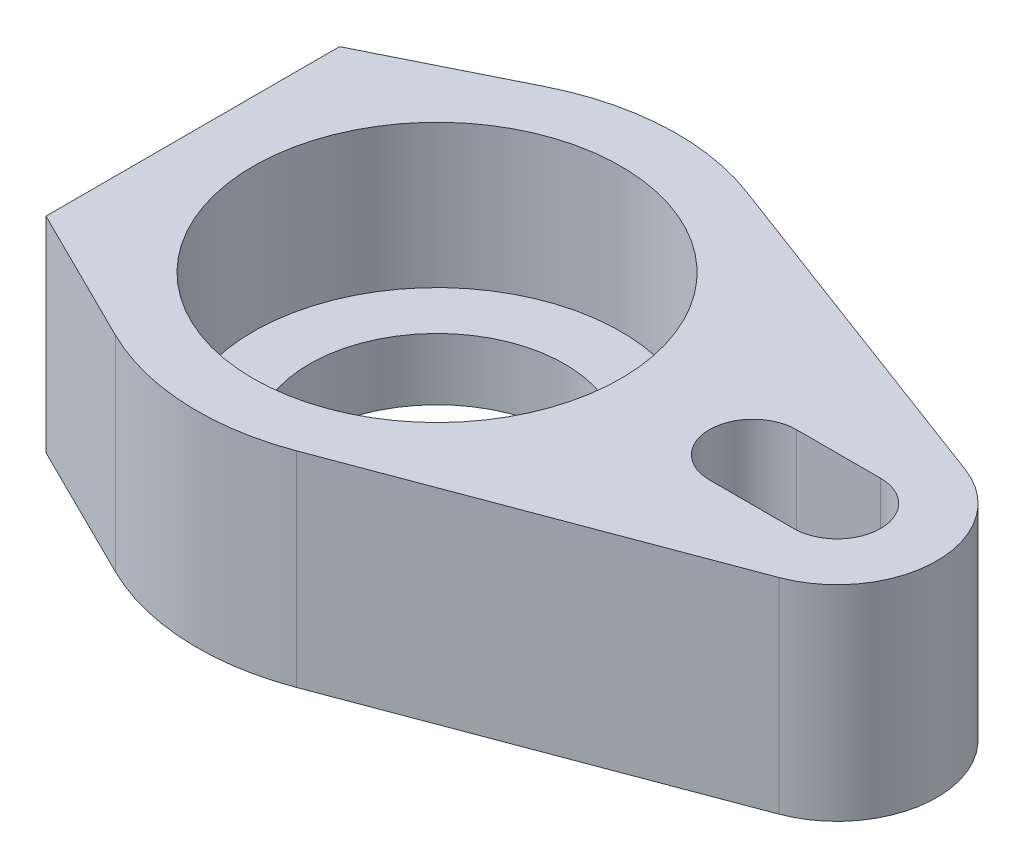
from build123d import *

# Parameters (mm, degrees)
SKETCH1_R     = 6.55
BODY_DEPTH    = 7.3
FLOOR_2_DEPTH = 2.2


with BuildPart() as part:
    # Sketch1 → Body (new body)
    with BuildSketch(Plane(origin=(0, 0, 0), x_dir=(1, 0, 0), z_dir=(0, 1, 0))):
        with BuildLine():
            Line((3, -8.006403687), (15.495614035, -3.324296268))
            ThreePointArc((15.495614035, -3.324296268), (17.8, 0), (15.495614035, 3.324296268))
            Line((15.495614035, 3.324296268), (3, 8.006403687))
            ThreePointArc((3, 8.006403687), (-0.436058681, 8.538873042), (-3.8, 7.659144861))
            Line((-3.8, 7.659144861), (-8.7, 5.228064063))
            Line((-8.7, 5.228064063), (-8.7, -5.228064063))
            Line((-8.7, -5.228064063), (-3.8, -7.659144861))
            ThreePointArc((-3.8, -7.659144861), (-0.436058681, -8.538873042), (3, -8.006403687))
        make_face()
        with Locations(Location((0, 0, 0), (0, 0, 270))):
            Circle(SKETCH1_R, mode=Mode.SUBTRACT)
        with BuildLine():
            Line((11.25, 1.55), (14.25, 1.55))
            ThreePointArc((14.25, 1.55), (15.8, 0), (14.25, -1.55))
            Line((14.25, -1.55), (11.25, -1.55))
            ThreePointArc((11.25, -1.55), (9.7, 0), (11.25, 1.55))
        make_face(mode=Mode.SUBTRACT)
    extrude(amount=BODY_DEPTH)

    # Sketch1_4 → Floor 2 (add)
    with BuildSketch(Plane(origin=(0, 0, 0), x_dir=(1, 0, 0), z_dir=(0, 1, 0))):
        with BuildLine():
            ThreePointArc((6.55, 0), (6.413226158, 1.33155182), (6.008616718, 2.607494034))
            Line((6.008616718, 2.607494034), (1.596491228, 4.260717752))
            ThreePointArc((1.596491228, 4.260717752), (3.73942075, 2.592148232), (4.55, 0))
            ThreePointArc((4.55, 0), (2.398060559, -3.866756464), (-2.022222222, -4.075919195))
            Line((-2.022222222, -4.075919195), (-6.242982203, -1.981835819))
            ThreePointArc((-6.242982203, -1.981835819), (-4.972324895, -4.263623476), (-2.911111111, -5.867532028))
            ThreePointArc((-2.911111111, -5.867532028), (-0.33405665, -6.541475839), (2.298245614, -6.133560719))
            ThreePointArc((2.298245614, -6.133560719), (5.383122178, -3.731554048), (6.55, 0))
        make_face()
        with BuildLine():
            Line((1.596491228, 4.260717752), (6.008616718, 2.607494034))
            ThreePointArc((6.008616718, 2.607494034), (4.512125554, 4.747970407), (2.298245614, 6.133560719))
            ThreePointArc((2.298245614, 6.133560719), (-0.33405665, 6.541475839), (-2.911111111, 5.867532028))
            ThreePointArc((-2.911111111, 5.867532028), (-6.029303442, 2.559296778), (-6.242982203, -1.981835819))
            Line((-6.242982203, -1.981835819), (-2.022222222, -4.075919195))
            ThreePointArc((-2.022222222, -4.075919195), (-4.173750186, 1.811714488), (1.596491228, 4.260717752))
        make_face()
        with BuildLine():
            ThreePointArc((6.55, 0), (6.413226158, 1.33155182), (6.008616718, 2.607494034))
            Line((6.008616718, 2.607494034), (1.596491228, 4.260717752))
            ThreePointArc((1.596491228, 4.260717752), (3.73942075, 2.592148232), (4.55, 0))
            ThreePointArc((4.55, 0), (2.398060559, -3.866756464), (-2.022222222, -4.075919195))
            Line((-2.022222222, -4.075919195), (-6.242982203, -1.981835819))
            ThreePointArc((-6.242982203, -1.981835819), (-4.972324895, -4.263623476), (-2.911111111, -5.867532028))
            ThreePointArc((-2.911111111, -5.867532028), (-0.33405665, -6.541475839), (2.298245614, -6.133560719))
            ThreePointArc((2.298245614, -6.133560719), (5.383122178, -3.731554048), (6.55, 0))
        make_face()
        with BuildLine():
            Line((1.596491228, 4.260717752), (6.008616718, 2.607494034))
            ThreePointArc((6.008616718, 2.607494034), (4.512125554, 4.747970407), (2.298245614, 6.133560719))
            ThreePointArc((2.298245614, 6.133560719), (-0.33405665, 6.541475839), (-2.911111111, 5.867532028))
            ThreePointArc((-2.911111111, 5.867532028), (-6.029303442, 2.559296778), (-6.242982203, -1.981835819))
            Line((-6.242982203, -1.981835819), (-2.022222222, -4.075919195))
            ThreePointArc((-2.022222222, -4.075919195), (-4.173750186, 1.811714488), (1.596491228, 4.260717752))
        make_face()
    extrude(amount=FLOOR_2_DEPTH)


solid = part.part
